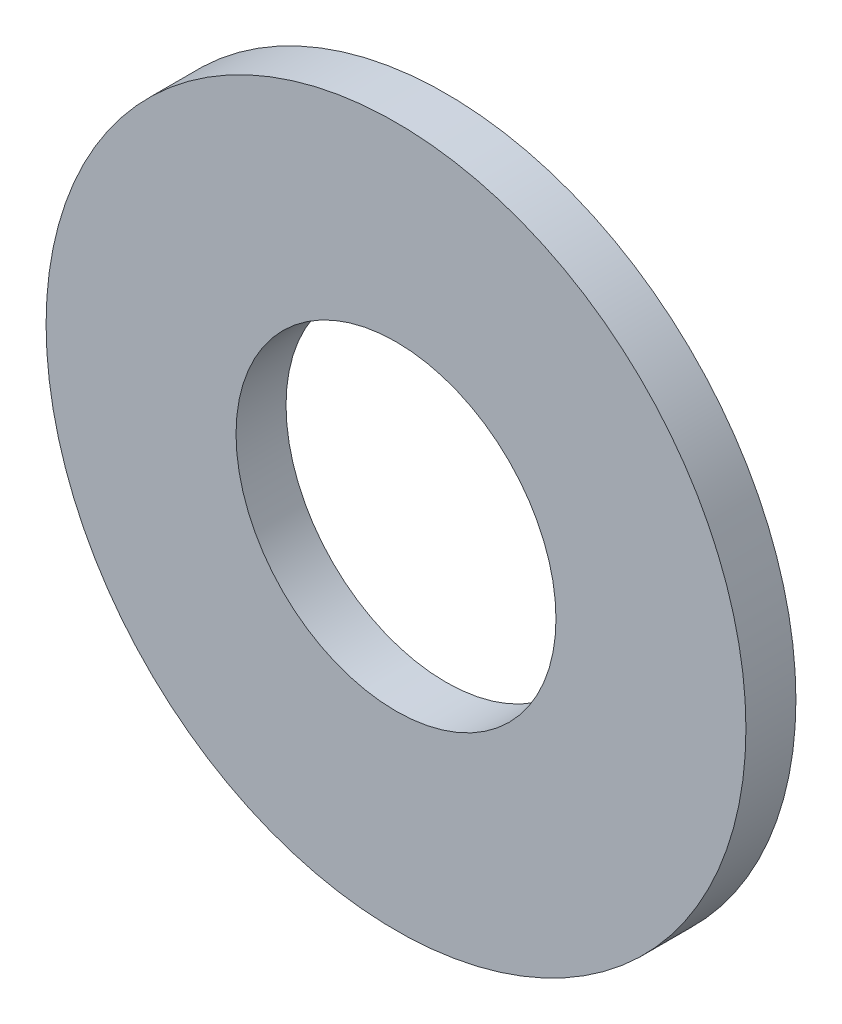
ISO-10303-21;
HEADER;
FILE_DESCRIPTION(('STEP AP214'),'2;1');
FILE_NAME('part.step','',(''),(''),'','','');
FILE_SCHEMA(('AUTOMOTIVE_DESIGN { 1 0 10303 214 1 1 1 1 }'));
ENDSEC;
DATA;
#1=APPLICATION_CONTEXT('core data for automotive mechanical design processes');
#2=APPLICATION_PROTOCOL_DEFINITION('international standard','automotive_design',2000,#1);
#3=PRODUCT_CONTEXT('',#1,'mechanical');
#4=PRODUCT('Part','Part','',(#3));
#5=PRODUCT_RELATED_PRODUCT_CATEGORY('part','',(#4));
#6=PRODUCT_DEFINITION_FORMATION('','',#4);
#7=PRODUCT_DEFINITION_CONTEXT('part definition',#1,'design');
#8=PRODUCT_DEFINITION('design','',#6,#7);
#9=PRODUCT_DEFINITION_SHAPE('','',#8);
#10=(LENGTH_UNIT() NAMED_UNIT(*) SI_UNIT(.MILLI.,.METRE.));
#11=(NAMED_UNIT(*) PLANE_ANGLE_UNIT() SI_UNIT($,.RADIAN.));
#12=(NAMED_UNIT(*) SI_UNIT($,.STERADIAN.) SOLID_ANGLE_UNIT());
#13=UNCERTAINTY_MEASURE_WITH_UNIT(LENGTH_MEASURE(1.E-05),#10,'distance_accuracy_value','');
#14=(GEOMETRIC_REPRESENTATION_CONTEXT(3) GLOBAL_UNCERTAINTY_ASSIGNED_CONTEXT((#13)) GLOBAL_UNIT_ASSIGNED_CONTEXT((#10,
#11,#12)) REPRESENTATION_CONTEXT('',''));
#15=CARTESIAN_POINT('',(0.,0.,0.));
#16=DIRECTION('',(0.,0.,1.));
#17=DIRECTION('',(1.,0.,0.));
#18=AXIS2_PLACEMENT_3D('',#15,#16,#17);
#19=CARTESIAN_POINT('',(0.,0.,-0.5));
#20=DIRECTION('',(0.,0.,1.));
#21=DIRECTION('',(1.,0.,0.));
#22=AXIS2_PLACEMENT_3D('',#19,#20,#21);
#23=CYLINDRICAL_SURFACE('',#22,3.5);
#24=CARTESIAN_POINT('',(0.,0.,-0.5));
#25=DIRECTION('',(0.,0.,1.));
#26=DIRECTION('',(1.,0.,0.));
#27=AXIS2_PLACEMENT_3D('',#24,#25,#26);
#28=CIRCLE('',#27,3.5);
#29=CARTESIAN_POINT('',(3.5,0.,-0.5));
#30=VERTEX_POINT('',#29);
#31=EDGE_CURVE('E10',#30,#30,#28,.T.);
#32=ORIENTED_EDGE('',*,*,#31,.T.);
#33=EDGE_LOOP('',(#32));
#34=FACE_BOUND('',#33,.T.);
#35=CARTESIAN_POINT('',(0.,0.,0.));
#36=DIRECTION('',(0.,0.,1.));
#37=DIRECTION('',(1.,0.,0.));
#38=AXIS2_PLACEMENT_3D('',#35,#36,#37);
#39=CIRCLE('',#38,3.5);
#40=CARTESIAN_POINT('',(3.5,0.,0.));
#41=VERTEX_POINT('',#40);
#42=EDGE_CURVE('E44',#41,#41,#39,.T.);
#43=ORIENTED_EDGE('',*,*,#42,.F.);
#44=EDGE_LOOP('',(#43));
#45=FACE_BOUND('',#44,.T.);
#46=ADVANCED_FACE('F40',(#34,#45),#23,.T.);
#47=CARTESIAN_POINT('',(0.,0.,-0.5));
#48=DIRECTION('',(0.,0.,1.));
#49=DIRECTION('',(1.,0.,0.));
#50=AXIS2_PLACEMENT_3D('',#47,#48,#49);
#51=PLANE('',#50);
#52=CARTESIAN_POINT('',(0.,0.,-0.5));
#53=DIRECTION('',(0.,0.,1.));
#54=DIRECTION('',(1.,0.,0.));
#55=AXIS2_PLACEMENT_3D('',#52,#53,#54);
#56=CIRCLE('',#55,1.6);
#57=CARTESIAN_POINT('',(1.6,0.,-0.5));
#58=VERTEX_POINT('',#57);
#59=EDGE_CURVE('E64',#58,#58,#56,.T.);
#60=ORIENTED_EDGE('',*,*,#59,.T.);
#61=EDGE_LOOP('',(#60));
#62=FACE_BOUND('',#61,.T.);
#63=ORIENTED_EDGE('',*,*,#31,.F.);
#64=EDGE_LOOP('',(#63));
#65=FACE_BOUND('',#64,.T.);
#66=ADVANCED_FACE('F67',(#62,#65),#51,.F.);
#67=CARTESIAN_POINT('',(0.,0.,0.));
#68=DIRECTION('',(0.,0.,1.));
#69=DIRECTION('',(1.,0.,0.));
#70=AXIS2_PLACEMENT_3D('',#67,#68,#69);
#71=PLANE('',#70);
#72=CARTESIAN_POINT('',(0.,0.,1.2E-05));
#73=DIRECTION('',(0.,0.,1.));
#74=DIRECTION('',(1.,0.,0.));
#75=AXIS2_PLACEMENT_3D('',#72,#73,#74);
#76=CIRCLE('',#75,1.6);
#77=CARTESIAN_POINT('',(1.6,0.,1.2E-05));
#78=VERTEX_POINT('',#77);
#79=EDGE_CURVE('E49',#78,#78,#76,.T.);
#80=ORIENTED_EDGE('',*,*,#79,.F.);
#81=EDGE_LOOP('',(#80));
#82=FACE_BOUND('',#81,.T.);
#83=ORIENTED_EDGE('',*,*,#42,.T.);
#84=EDGE_LOOP('',(#83));
#85=FACE_BOUND('',#84,.T.);
#86=ADVANCED_FACE('F58',(#82,#85),#71,.T.);
#87=CARTESIAN_POINT('',(0.,0.,1.2E-05));
#88=DIRECTION('',(0.,0.,-1.));
#89=DIRECTION('',(-1.,0.,0.));
#90=AXIS2_PLACEMENT_3D('',#87,#88,#89);
#91=CYLINDRICAL_SURFACE('',#90,1.6);
#92=ORIENTED_EDGE('',*,*,#79,.T.);
#93=EDGE_LOOP('',(#92));
#94=FACE_BOUND('',#93,.T.);
#95=ORIENTED_EDGE('',*,*,#59,.F.);
#96=EDGE_LOOP('',(#95));
#97=FACE_BOUND('',#96,.T.);
#98=ADVANCED_FACE('F72',(#94,#97),#91,.F.);
#99=CLOSED_SHELL('',(#46,#66,#86,#98));
#100=MANIFOLD_SOLID_BREP('B2',#99);
#101=ADVANCED_BREP_SHAPE_REPRESENTATION('',(#18,#100),#14);
#102=SHAPE_DEFINITION_REPRESENTATION(#9,#101);
ENDSEC;
END-ISO-10303-21;
